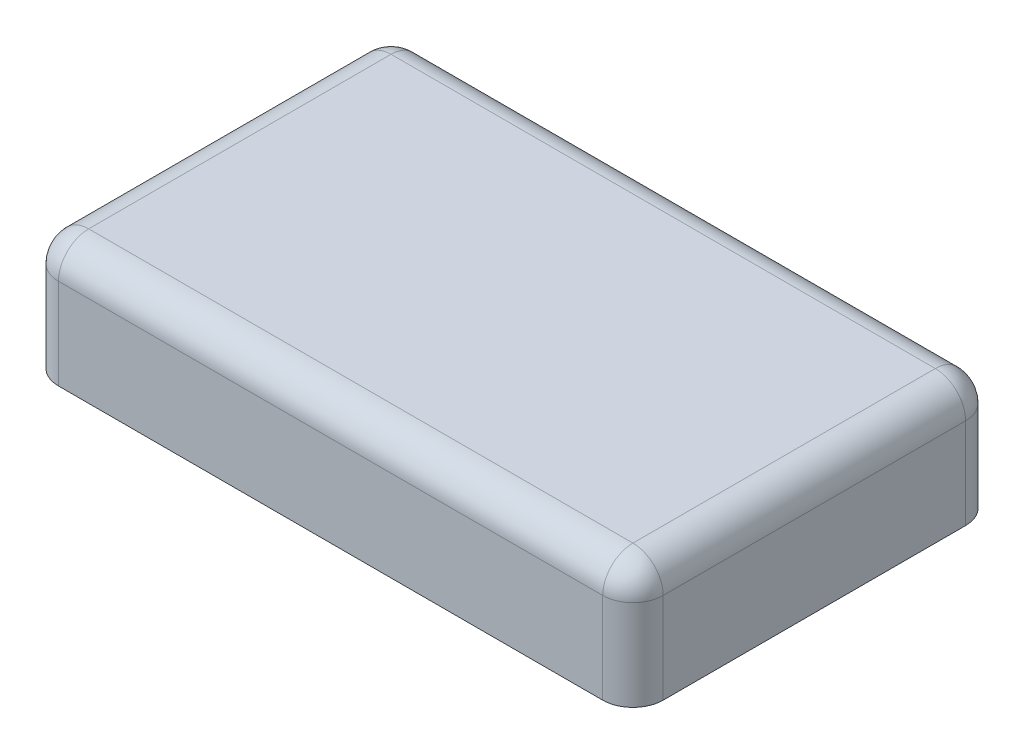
from build123d import *

# Parameters (mm, degrees)
SKETCH2_W           = 127
SKETCH2_H           = 76.2
BOSS_EXTRUDE1_DEPTH = 25.4
FILLET1_R           = 6.35
FILLET2_R           = 6.35


with BuildPart() as part:
    # Sketch2 → Boss-Extrude1 (new body)
    with BuildSketch(Plane(origin=(0, 0, 0), x_dir=(1, 0, 0), z_dir=(0, 1, 0))):
        Rectangle(SKETCH2_W, SKETCH2_H)
    extrude(amount=BOSS_EXTRUDE1_DEPTH)

    # Fillet1
    fillet1_edges = [part.edges().sort_by_distance(p)[0] for p in [
        (63.5, 12.7, 38.1),
        (-63.5, 12.7, 38.1),
        (-63.5, 12.7, -38.1),
        (63.5, 12.7, -38.1),
    ]]
    fillet(fillet1_edges, radius=FILLET1_R)

    # Fillet2
    fillet2_edges = [part.edges().sort_by_distance(p)[0] for p in [
        (63.5, 25.4, 0),
        (0, 25.4, 38.1),
        (0, 25.4, -38.1),
        (-63.5, 25.4, 0),
        (-61.640128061, 25.4, 36.240128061),
        (61.640128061, 25.4, -36.240128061),
        (-61.640128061, 25.4, -36.240128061),
        (61.640128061, 25.4, 36.240128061),
    ]]
    fillet(fillet2_edges, radius=FILLET2_R)


solid = part.part
